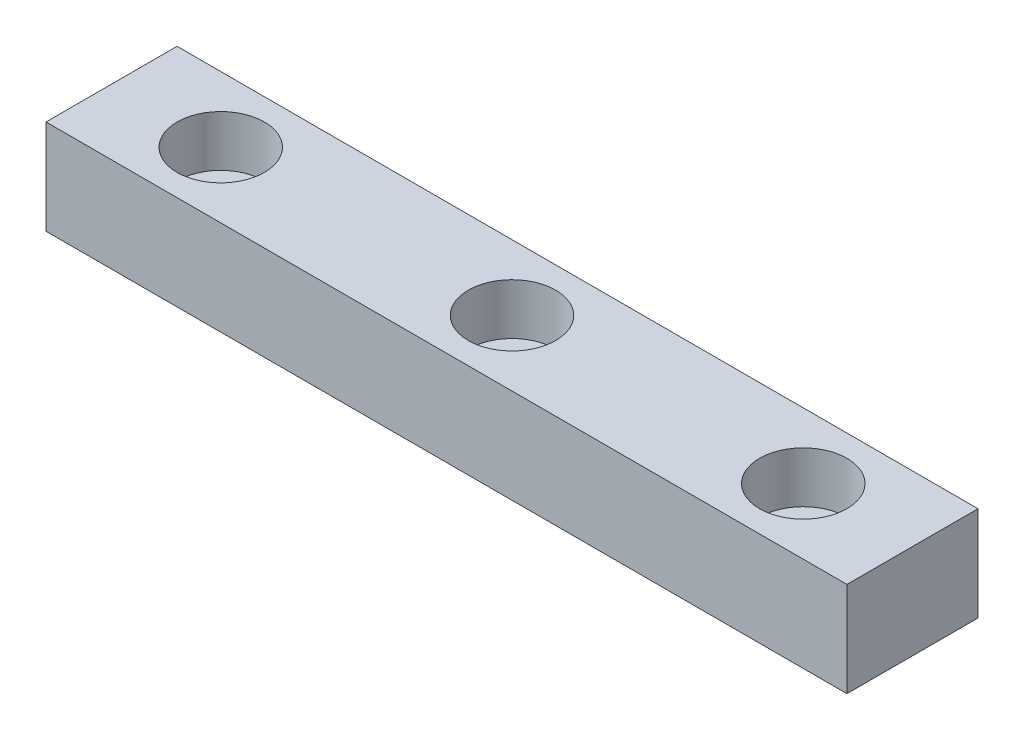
from build123d import *

# Parameters (mm, degrees)
SKETCH_1_W          = 55
SKETCH_1_H          = 6.5
EXTRUDE_1_DEPTH     = 9
SKETCH_2_R          = 1.75
CUT_EXTRUDE_1_DEPTH = 9
SKETCH_3_R          = 3
CUT_EXTRUDE_2_DEPTH = 3.5


with BuildPart() as part:
    # Sketch 1 → Extrude 1 (new body)
    with BuildSketch(Plane.XY):
        with Locations((27.5, 3.25)):
            Rectangle(SKETCH_1_W, SKETCH_1_H)
    extrude(amount=EXTRUDE_1_DEPTH)

    # Sketch 2 → Cut-Extrude 1 (cut)
    with BuildSketch(Plane(origin=(0, 6.5, 0), x_dir=(1, 0, 0), z_dir=(0, 1, 0))):
        with Locations(Location((7.5, -4.5, 0), (0, 0, 270))):
            Circle(SKETCH_2_R)
        with Locations(Location((27.5, -4.5, 0), (0, 0, 270))):
            Circle(SKETCH_2_R)
        with Locations(Location((47.5, -4.5, 0), (0, 0, 270))):
            Circle(SKETCH_2_R)
    extrude(amount=-CUT_EXTRUDE_1_DEPTH, mode=Mode.SUBTRACT)

    # Sketch 3 → Cut-Extrude 2 (cut)
    with BuildSketch(Plane(origin=(0, 6.5, 0), x_dir=(1, 0, 0), z_dir=(0, 1, 0))):
        with Locations(Location((47.5, -4.5, 0), (0, 0, 270))):
            Circle(SKETCH_3_R)
        with Locations(Location((27.5, -4.5, 0), (0, 0, 270))):
            Circle(SKETCH_3_R)
        with Locations(Location((7.5, -4.5, 0), (0, 0, 270))):
            Circle(SKETCH_3_R)
    extrude(amount=-CUT_EXTRUDE_2_DEPTH, mode=Mode.SUBTRACT)


solid = part.part
